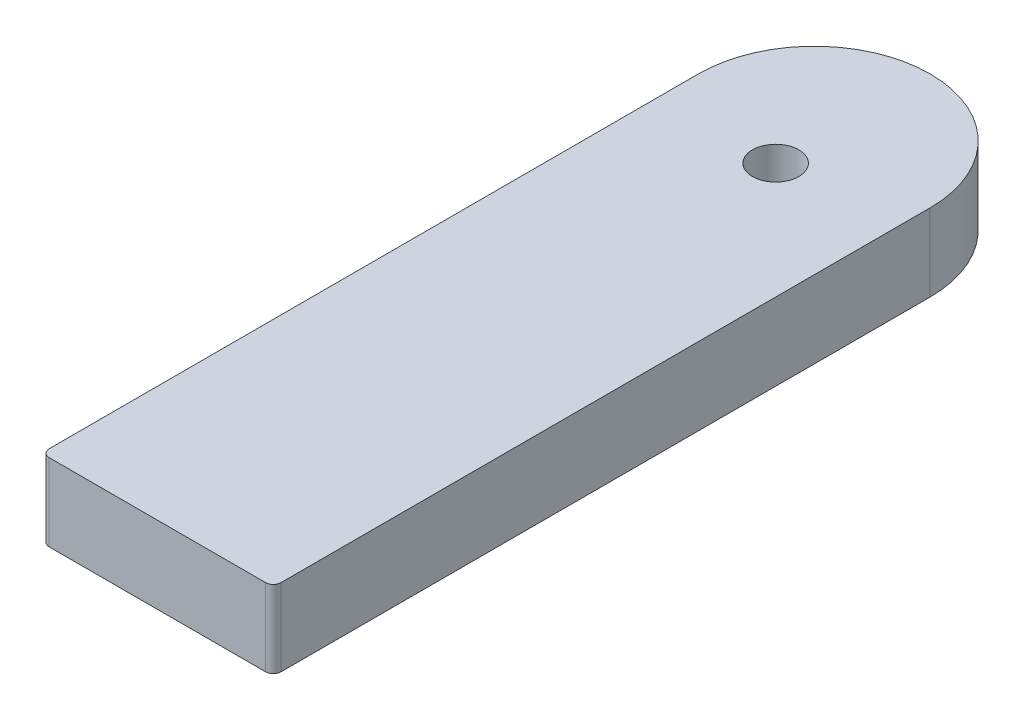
ISO-10303-21;
HEADER;
FILE_DESCRIPTION(('STEP AP214'),'2;1');
FILE_NAME('part.step','',(''),(''),'','','');
FILE_SCHEMA(('AUTOMOTIVE_DESIGN { 1 0 10303 214 1 1 1 1 }'));
ENDSEC;
DATA;
#1=APPLICATION_CONTEXT('core data for automotive mechanical design processes');
#2=APPLICATION_PROTOCOL_DEFINITION('international standard','automotive_design',2000,#1);
#3=PRODUCT_CONTEXT('',#1,'mechanical');
#4=PRODUCT('Part','Part','',(#3));
#5=PRODUCT_RELATED_PRODUCT_CATEGORY('part','',(#4));
#6=PRODUCT_DEFINITION_FORMATION('','',#4);
#7=PRODUCT_DEFINITION_CONTEXT('part definition',#1,'design');
#8=PRODUCT_DEFINITION('design','',#6,#7);
#9=PRODUCT_DEFINITION_SHAPE('','',#8);
#10=(LENGTH_UNIT() NAMED_UNIT(*) SI_UNIT(.MILLI.,.METRE.));
#11=(NAMED_UNIT(*) PLANE_ANGLE_UNIT() SI_UNIT($,.RADIAN.));
#12=(NAMED_UNIT(*) SI_UNIT($,.STERADIAN.) SOLID_ANGLE_UNIT());
#13=UNCERTAINTY_MEASURE_WITH_UNIT(LENGTH_MEASURE(1.E-05),#10,'distance_accuracy_value','');
#14=(GEOMETRIC_REPRESENTATION_CONTEXT(3) GLOBAL_UNCERTAINTY_ASSIGNED_CONTEXT((#13)) GLOBAL_UNIT_ASSIGNED_CONTEXT((#10,
#11,#12)) REPRESENTATION_CONTEXT('',''));
#15=CARTESIAN_POINT('',(0.,0.,0.));
#16=DIRECTION('',(0.,0.,1.));
#17=DIRECTION('',(1.,0.,0.));
#18=AXIS2_PLACEMENT_3D('',#15,#16,#17);
#19=CARTESIAN_POINT('',(0.,10.,0.));
#20=DIRECTION('',(1.,0.,0.));
#21=DIRECTION('',(0.,0.,-1.));
#22=AXIS2_PLACEMENT_3D('',#19,#20,#21);
#23=PLANE('',#22);
#24=DIRECTION('',(0.,0.,1.));
#25=VECTOR('',#24,1.);
#26=CARTESIAN_POINT('',(0.,0.,0.));
#27=LINE('',#26,#25);
#28=CARTESIAN_POINT('',(0.,0.,-85.));
#29=VERTEX_POINT('',#28);
#30=CARTESIAN_POINT('',(0.,0.,-1.));
#31=VERTEX_POINT('',#30);
#32=EDGE_CURVE('E107',#29,#31,#27,.T.);
#33=ORIENTED_EDGE('',*,*,#32,.T.);
#34=DIRECTION('',(0.,-1.,0.));
#35=VECTOR('',#34,1.);
#36=CARTESIAN_POINT('',(0.,10.,-1.));
#37=LINE('',#36,#35);
#38=CARTESIAN_POINT('',(0.,10.,-1.));
#39=VERTEX_POINT('',#38);
#40=EDGE_CURVE('E11',#31,#39,#37,.F.);
#41=ORIENTED_EDGE('',*,*,#40,.T.);
#42=DIRECTION('',(0.,0.,1.));
#43=VECTOR('',#42,1.);
#44=CARTESIAN_POINT('',(0.,10.,0.));
#45=LINE('',#44,#43);
#46=CARTESIAN_POINT('',(0.,10.,-85.));
#47=VERTEX_POINT('',#46);
#48=EDGE_CURVE('E108',#47,#39,#45,.T.);
#49=ORIENTED_EDGE('',*,*,#48,.F.);
#50=DIRECTION('',(0.,-1.,0.));
#51=VECTOR('',#50,1.);
#52=CARTESIAN_POINT('',(0.,10.,-85.));
#53=LINE('',#52,#51);
#54=EDGE_CURVE('E97',#47,#29,#53,.T.);
#55=ORIENTED_EDGE('',*,*,#54,.T.);
#56=EDGE_LOOP('',(#33,#41,#49,#55));
#57=FACE_BOUND('',#56,.T.);
#58=ADVANCED_FACE('F32',(#57),#23,.F.);
#59=CARTESIAN_POINT('',(0.,10.,0.));
#60=DIRECTION('',(0.,0.,-1.));
#61=DIRECTION('',(-1.,0.,0.));
#62=AXIS2_PLACEMENT_3D('',#59,#60,#61);
#63=PLANE('',#62);
#64=DIRECTION('',(1.,0.,0.));
#65=VECTOR('',#64,1.);
#66=CARTESIAN_POINT('',(0.,0.,0.));
#67=LINE('',#66,#65);
#68=CARTESIAN_POINT('',(1.,0.,0.));
#69=VERTEX_POINT('',#68);
#70=CARTESIAN_POINT('',(29.,0.,0.));
#71=VERTEX_POINT('',#70);
#72=EDGE_CURVE('E115',#69,#71,#67,.T.);
#73=ORIENTED_EDGE('',*,*,#72,.T.);
#74=DIRECTION('',(0.,-1.,0.));
#75=VECTOR('',#74,1.);
#76=CARTESIAN_POINT('',(29.,10.,0.));
#77=LINE('',#76,#75);
#78=CARTESIAN_POINT('',(29.,10.,0.));
#79=VERTEX_POINT('',#78);
#80=EDGE_CURVE('E53',#71,#79,#77,.F.);
#81=ORIENTED_EDGE('',*,*,#80,.T.);
#82=DIRECTION('',(1.,0.,0.));
#83=VECTOR('',#82,1.);
#84=CARTESIAN_POINT('',(0.,10.,0.));
#85=LINE('',#84,#83);
#86=CARTESIAN_POINT('',(1.,10.,0.));
#87=VERTEX_POINT('',#86);
#88=EDGE_CURVE('E150',#87,#79,#85,.T.);
#89=ORIENTED_EDGE('',*,*,#88,.F.);
#90=DIRECTION('',(0.,-1.,0.));
#91=VECTOR('',#90,1.);
#92=CARTESIAN_POINT('',(1.,10.,0.));
#93=LINE('',#92,#91);
#94=EDGE_CURVE('E141',#87,#69,#93,.T.);
#95=ORIENTED_EDGE('',*,*,#94,.T.);
#96=EDGE_LOOP('',(#73,#81,#89,#95));
#97=FACE_BOUND('',#96,.T.);
#98=ADVANCED_FACE('F158',(#97),#63,.F.);
#99=CARTESIAN_POINT('',(30.,10.,0.));
#100=DIRECTION('',(-1.,0.,0.));
#101=DIRECTION('',(0.,0.,1.));
#102=AXIS2_PLACEMENT_3D('',#99,#100,#101);
#103=PLANE('',#102);
#104=DIRECTION('',(0.,0.,-1.));
#105=VECTOR('',#104,1.);
#106=CARTESIAN_POINT('',(30.,10.,0.));
#107=LINE('',#106,#105);
#108=CARTESIAN_POINT('',(30.,10.,-1.));
#109=VERTEX_POINT('',#108);
#110=CARTESIAN_POINT('',(30.,10.,-85.));
#111=VERTEX_POINT('',#110);
#112=EDGE_CURVE('E109',#109,#111,#107,.T.);
#113=ORIENTED_EDGE('',*,*,#112,.F.);
#114=DIRECTION('',(0.,-1.,0.));
#115=VECTOR('',#114,1.);
#116=CARTESIAN_POINT('',(30.,10.,-1.));
#117=LINE('',#116,#115);
#118=CARTESIAN_POINT('',(30.,0.,-1.));
#119=VERTEX_POINT('',#118);
#120=EDGE_CURVE('E134',#109,#119,#117,.T.);
#121=ORIENTED_EDGE('',*,*,#120,.T.);
#122=DIRECTION('',(0.,0.,-1.));
#123=VECTOR('',#122,1.);
#124=CARTESIAN_POINT('',(30.,0.,0.));
#125=LINE('',#124,#123);
#126=CARTESIAN_POINT('',(30.,0.,-85.));
#127=VERTEX_POINT('',#126);
#128=EDGE_CURVE('E118',#119,#127,#125,.T.);
#129=ORIENTED_EDGE('',*,*,#128,.T.);
#130=DIRECTION('',(0.,-1.,0.));
#131=VECTOR('',#130,1.);
#132=CARTESIAN_POINT('',(30.,10.,-85.));
#133=LINE('',#132,#131);
#134=EDGE_CURVE('E131',#127,#111,#133,.F.);
#135=ORIENTED_EDGE('',*,*,#134,.T.);
#136=EDGE_LOOP('',(#113,#121,#129,#135));
#137=FACE_BOUND('',#136,.T.);
#138=ADVANCED_FACE('F154',(#137),#103,.F.);
#139=CARTESIAN_POINT('',(0.,10.,0.));
#140=DIRECTION('',(0.,-1.,0.));
#141=DIRECTION('',(0.,0.,-1.));
#142=AXIS2_PLACEMENT_3D('',#139,#140,#141);
#143=PLANE('',#142);
#144=CARTESIAN_POINT('',(15.,10.,-80.));
#145=DIRECTION('',(0.,1.,0.));
#146=DIRECTION('',(0.,0.,1.));
#147=AXIS2_PLACEMENT_3D('',#144,#145,#146);
#148=CIRCLE('',#147,3.);
#149=CARTESIAN_POINT('',(15.,10.,-77.));
#150=VERTEX_POINT('',#149);
#151=EDGE_CURVE('E121',#150,#150,#148,.T.);
#152=ORIENTED_EDGE('',*,*,#151,.F.);
#153=EDGE_LOOP('',(#152));
#154=FACE_BOUND('',#153,.T.);
#155=ORIENTED_EDGE('',*,*,#88,.T.);
#156=CARTESIAN_POINT('',(29.,10.,-1.));
#157=DIRECTION('',(0.,-1.,0.));
#158=DIRECTION('',(0.,0.,-1.));
#159=AXIS2_PLACEMENT_3D('',#156,#157,#158);
#160=CIRCLE('',#159,1.);
#161=EDGE_CURVE('E40',#79,#109,#160,.F.);
#162=ORIENTED_EDGE('',*,*,#161,.T.);
#163=ORIENTED_EDGE('',*,*,#112,.T.);
#164=CARTESIAN_POINT('',(15.,10.,-85.));
#165=DIRECTION('',(0.,-1.,0.));
#166=DIRECTION('',(0.,0.,-1.));
#167=AXIS2_PLACEMENT_3D('',#164,#165,#166);
#168=CIRCLE('',#167,15.);
#169=CARTESIAN_POINT('',(15.,10.,-100.));
#170=VERTEX_POINT('',#169);
#171=EDGE_CURVE('E104',#111,#170,#168,.F.);
#172=ORIENTED_EDGE('',*,*,#171,.T.);
#173=CARTESIAN_POINT('',(15.,10.,-85.));
#174=DIRECTION('',(0.,-1.,0.));
#175=DIRECTION('',(0.,0.,-1.));
#176=AXIS2_PLACEMENT_3D('',#173,#174,#175);
#177=CIRCLE('',#176,15.);
#178=EDGE_CURVE('E129',#170,#47,#177,.F.);
#179=ORIENTED_EDGE('',*,*,#178,.T.);
#180=ORIENTED_EDGE('',*,*,#48,.T.);
#181=CARTESIAN_POINT('',(1.,10.,-1.));
#182=DIRECTION('',(0.,-1.,0.));
#183=DIRECTION('',(0.,0.,-1.));
#184=AXIS2_PLACEMENT_3D('',#181,#182,#183);
#185=CIRCLE('',#184,1.);
#186=EDGE_CURVE('E145',#39,#87,#185,.F.);
#187=ORIENTED_EDGE('',*,*,#186,.T.);
#188=EDGE_LOOP('',(#155,#162,#163,#172,#179,#180,#187));
#189=FACE_BOUND('',#188,.T.);
#190=ADVANCED_FACE('F149',(#154,#189),#143,.F.);
#191=CARTESIAN_POINT('',(0.,0.,0.));
#192=DIRECTION('',(0.,-1.,0.));
#193=DIRECTION('',(0.,0.,-1.));
#194=AXIS2_PLACEMENT_3D('',#191,#192,#193);
#195=PLANE('',#194);
#196=CARTESIAN_POINT('',(15.,0.,-80.));
#197=DIRECTION('',(0.,-1.,0.));
#198=DIRECTION('',(0.,0.,-1.));
#199=AXIS2_PLACEMENT_3D('',#196,#197,#198);
#200=CIRCLE('',#199,3.);
#201=CARTESIAN_POINT('',(15.,0.,-83.));
#202=VERTEX_POINT('',#201);
#203=EDGE_CURVE('E116',#202,#202,#200,.T.);
#204=ORIENTED_EDGE('',*,*,#203,.F.);
#205=EDGE_LOOP('',(#204));
#206=FACE_BOUND('',#205,.T.);
#207=ORIENTED_EDGE('',*,*,#128,.F.);
#208=CARTESIAN_POINT('',(29.,0.,-1.));
#209=DIRECTION('',(0.,-1.,0.));
#210=DIRECTION('',(0.,0.,-1.));
#211=AXIS2_PLACEMENT_3D('',#208,#209,#210);
#212=CIRCLE('',#211,1.);
#213=EDGE_CURVE('E139',#119,#71,#212,.T.);
#214=ORIENTED_EDGE('',*,*,#213,.T.);
#215=ORIENTED_EDGE('',*,*,#72,.F.);
#216=CARTESIAN_POINT('',(1.,0.,-1.));
#217=DIRECTION('',(0.,-1.,0.));
#218=DIRECTION('',(0.,0.,-1.));
#219=AXIS2_PLACEMENT_3D('',#216,#217,#218);
#220=CIRCLE('',#219,1.);
#221=EDGE_CURVE('E114',#69,#31,#220,.T.);
#222=ORIENTED_EDGE('',*,*,#221,.T.);
#223=ORIENTED_EDGE('',*,*,#32,.F.);
#224=CARTESIAN_POINT('',(15.,0.,-85.));
#225=DIRECTION('',(0.,-1.,0.));
#226=DIRECTION('',(0.,0.,-1.));
#227=AXIS2_PLACEMENT_3D('',#224,#225,#226);
#228=CIRCLE('',#227,15.);
#229=CARTESIAN_POINT('',(15.,0.,-100.));
#230=VERTEX_POINT('',#229);
#231=EDGE_CURVE('E93',#29,#230,#228,.T.);
#232=ORIENTED_EDGE('',*,*,#231,.T.);
#233=CARTESIAN_POINT('',(15.,0.,-85.));
#234=DIRECTION('',(0.,-1.,0.));
#235=DIRECTION('',(0.,0.,-1.));
#236=AXIS2_PLACEMENT_3D('',#233,#234,#235);
#237=CIRCLE('',#236,15.);
#238=EDGE_CURVE('E105',#230,#127,#237,.T.);
#239=ORIENTED_EDGE('',*,*,#238,.T.);
#240=EDGE_LOOP('',(#207,#214,#215,#222,#223,#232,#239));
#241=FACE_BOUND('',#240,.T.);
#242=ADVANCED_FACE('F112',(#206,#241),#195,.T.);
#243=CARTESIAN_POINT('',(15.,-6.,-80.));
#244=DIRECTION('',(0.,1.,0.));
#245=DIRECTION('',(0.,0.,1.));
#246=AXIS2_PLACEMENT_3D('',#243,#244,#245);
#247=CYLINDRICAL_SURFACE('',#246,3.);
#248=ORIENTED_EDGE('',*,*,#203,.T.);
#249=EDGE_LOOP('',(#248));
#250=FACE_BOUND('',#249,.T.);
#251=ORIENTED_EDGE('',*,*,#151,.T.);
#252=EDGE_LOOP('',(#251));
#253=FACE_BOUND('',#252,.T.);
#254=ADVANCED_FACE('F167',(#250,#253),#247,.F.);
#255=CARTESIAN_POINT('',(15.,10.,-85.));
#256=DIRECTION('',(0.,-1.,0.));
#257=DIRECTION('',(0.,0.,-1.));
#258=AXIS2_PLACEMENT_3D('',#255,#256,#257);
#259=CYLINDRICAL_SURFACE('',#258,15.);
#260=DIRECTION('',(0.,-1.,0.));
#261=VECTOR('',#260,1.);
#262=CARTESIAN_POINT('',(15.,10.,-100.));
#263=LINE('',#262,#261);
#264=EDGE_CURVE('E99',#170,#230,#263,.T.);
#265=ORIENTED_EDGE('',*,*,#264,.F.);
#266=ORIENTED_EDGE('',*,*,#171,.F.);
#267=ORIENTED_EDGE('',*,*,#134,.F.);
#268=ORIENTED_EDGE('',*,*,#238,.F.);
#269=EDGE_LOOP('',(#265,#266,#267,#268));
#270=FACE_BOUND('',#269,.T.);
#271=ADVANCED_FACE('F188',(#270),#259,.T.);
#272=CARTESIAN_POINT('',(15.,10.,-85.));
#273=DIRECTION('',(0.,-1.,0.));
#274=DIRECTION('',(0.,0.,-1.));
#275=AXIS2_PLACEMENT_3D('',#272,#273,#274);
#276=CYLINDRICAL_SURFACE('',#275,15.);
#277=ORIENTED_EDGE('',*,*,#178,.F.);
#278=ORIENTED_EDGE('',*,*,#264,.T.);
#279=ORIENTED_EDGE('',*,*,#231,.F.);
#280=ORIENTED_EDGE('',*,*,#54,.F.);
#281=EDGE_LOOP('',(#277,#278,#279,#280));
#282=FACE_BOUND('',#281,.T.);
#283=ADVANCED_FACE('F96',(#282),#276,.T.);
#284=CARTESIAN_POINT('',(29.,10.,-1.));
#285=DIRECTION('',(0.,-1.,0.));
#286=DIRECTION('',(0.,0.,-1.));
#287=AXIS2_PLACEMENT_3D('',#284,#285,#286);
#288=CYLINDRICAL_SURFACE('',#287,1.);
#289=ORIENTED_EDGE('',*,*,#161,.F.);
#290=ORIENTED_EDGE('',*,*,#80,.F.);
#291=ORIENTED_EDGE('',*,*,#213,.F.);
#292=ORIENTED_EDGE('',*,*,#120,.F.);
#293=EDGE_LOOP('',(#289,#290,#291,#292));
#294=FACE_BOUND('',#293,.T.);
#295=ADVANCED_FACE('F157',(#294),#288,.T.);
#296=CARTESIAN_POINT('',(1.,10.,-1.));
#297=DIRECTION('',(0.,-1.,0.));
#298=DIRECTION('',(0.,0.,-1.));
#299=AXIS2_PLACEMENT_3D('',#296,#297,#298);
#300=CYLINDRICAL_SURFACE('',#299,1.);
#301=ORIENTED_EDGE('',*,*,#186,.F.);
#302=ORIENTED_EDGE('',*,*,#40,.F.);
#303=ORIENTED_EDGE('',*,*,#221,.F.);
#304=ORIENTED_EDGE('',*,*,#94,.F.);
#305=EDGE_LOOP('',(#301,#302,#303,#304));
#306=FACE_BOUND('',#305,.T.);
#307=ADVANCED_FACE('F34',(#306),#300,.T.);
#308=CLOSED_SHELL('',(#58,#98,#138,#190,#242,#254,#271,#283,#295,#307));
#309=MANIFOLD_SOLID_BREP('B2',#308);
#310=ADVANCED_BREP_SHAPE_REPRESENTATION('',(#18,#309),#14);
#311=SHAPE_DEFINITION_REPRESENTATION(#9,#310);
ENDSEC;
END-ISO-10303-21;
